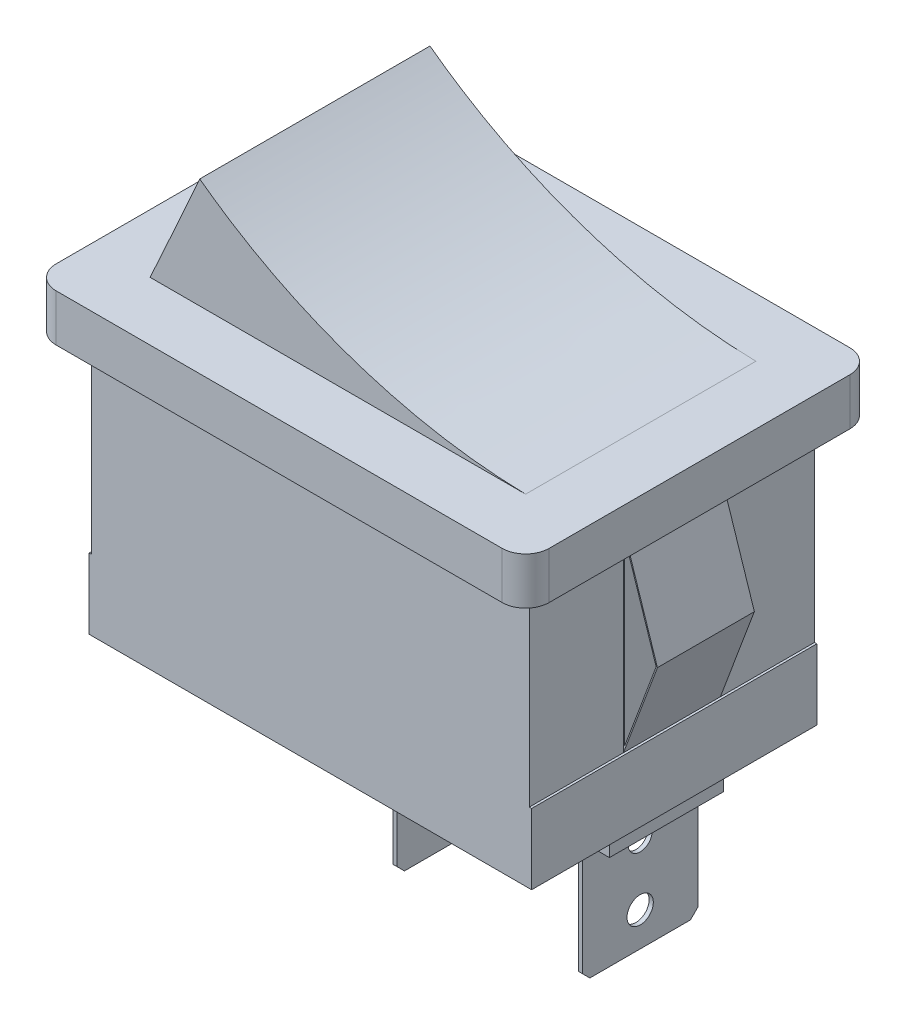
from build123d import *

# Parameters (mm, degrees)
SKETCH1_W           = 18.85
SKETCH1_H           = 12.15
BOSS_EXTRUDE1_DEPTH = 11.3
BOSS_EXTRUDE2_DEPTH = 2
BOSS_EXTRUDE4_DEPTH = 4.905
SKETCH5_W           = 12.15
SKETCH5_H           = 8.3
CUT_EXTRUDE2_DEPTH  = 0.1
BOSS_EXTRUDE5_DEPTH = 2.065
SKETCH7_W           = 1.12
SKETCH7_H           = 4.86
BOSS_EXTRUDE6_DEPTH = 0.8
LPATTERN1_COUNT     = 3
LPATTERN1_PITCH     = 7.9
BOSS_EXTRUDE7_DEPTH = 0.18
SKETCH9_R           = 0.513202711
SKETCH9_R_2         = 0.559835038
CUT_EXTRUDE3_DEPTH  = 0.18
LPATTERN11_COUNT    = 2
LPATTERN11_PITCH    = 7.9


with BuildPart() as part:
    # Sketch1 → Boss-Extrude1 (new body)
    with BuildSketch(Plane(origin=(0, 0, 0), x_dir=(1, 0, 0), z_dir=(0, 1, 0))):
        Rectangle(SKETCH1_W, SKETCH1_H)
    extrude(amount=BOSS_EXTRUDE1_DEPTH)

    # Sketch2 → Boss-Extrude2 (add)
    with BuildSketch(Plane(origin=(0, 11.3, 0), x_dir=(1, 0, 0), z_dir=(0, 1, 0))):
        with BuildLine():
            Line((9.5, -7.405), (-9.5, -7.405))
            ThreePointArc((-9.5, -7.405), (-10.207106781, -7.112106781), (-10.5, -6.405))
            Line((-10.5, -6.405), (-10.5, 6.405))
            ThreePointArc((-10.5, 6.405), (-10.207106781, 7.112106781), (-9.5, 7.405))
            Line((-9.5, 7.405), (9.5, 7.405))
            ThreePointArc((9.5, 7.405), (10.207106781, 7.112106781), (10.5, 6.405))
            Line((10.5, 6.405), (10.5, -6.405))
            ThreePointArc((10.5, -6.405), (10.207106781, -7.112106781), (9.5, -7.405))
        make_face()
    extrude(amount=BOSS_EXTRUDE2_DEPTH)

    # Sketch5 → Cut-Extrude2 (cut)
    with BuildSketch(Plane(origin=(9.425, 0, 0), x_dir=(0, 0, -1), z_dir=(1, 0, 0))):
        with Locations((0, 7.15)):
            Rectangle(SKETCH5_W, SKETCH5_H)
    cut_extrude2 = extrude(amount=-CUT_EXTRUDE2_DEPTH, mode=Mode.SUBTRACT)

    # Mirror1: Cut-Extrude2 across plane
    add(cut_extrude2.mirror(Plane(origin=(0, 0, 0), x_dir=(0, 0, 1), z_dir=(1, 0, 0))), mode=Mode.SUBTRACT)

    # Sketch6 → Boss-Extrude5 (add, symmetric)
    with BuildSketch(Plane.XY):
        Polygon((9.325, 3), (10.775, 6.867091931), (9.325, 11.3), align=None)
        Polygon((10.722023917, 6.868220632), (9.375, 10.986312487), (9.375, 3.275761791), align=None, mode=Mode.SUBTRACT)
    boss_extrude5 = extrude(amount=BOSS_EXTRUDE5_DEPTH, both=True)

    # Mirror2: Boss-Extrude5 across plane
    add(boss_extrude5.mirror(Plane(origin=(0, 0, 0), x_dir=(0, 0, 1), z_dir=(1, 0, 0))))

    # Sketch7 → Boss-Extrude6 (add)
    with BuildSketch(Plane.XZ):
        with Locations((-8.565, 0)):
            Rectangle(SKETCH7_W, SKETCH7_H)
        with Locations((-7.265, 0)):
            Rectangle(SKETCH7_W, SKETCH7_H)
    boss_extrude6 = extrude(amount=BOSS_EXTRUDE6_DEPTH)

    # LPattern1: Boss-Extrude6 ×3
    with Locations(*[(i * LPATTERN1_PITCH, 0, 0) for i in range(1, LPATTERN1_COUNT)]):
        add(boss_extrude6)

    # Sketch8 → Boss-Extrude7 (add)
    with BuildSketch(Plane(origin=(7.795, 0, 0), x_dir=(0, 0, -1), z_dir=(1, 0, 0))):
        with BuildLine():
            Line((2.762759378, 0), (2.762759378, -0.236886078))
            Line((2.762759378, -0.236886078), (2.602371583, -0.236886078))
            Line((2.602371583, -0.236886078), (2.457715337, -0.094744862))
            Line((2.457715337, -0.094744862), (2.457715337, -0.827279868))
            Line((2.457715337, -0.827279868), (2.349989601, -0.827279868))
            ThreePointArc((2.349989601, -0.827279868), (2.321976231, -0.886529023), (2.349989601, -0.945778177))
            Line((2.349989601, -0.945778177), (2.457715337, -0.945778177))
            Line((2.457715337, -0.945778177), (2.457715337, -5.631653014))
            Line((2.457715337, -5.631653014), (2.143590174, -5.945778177))
            Line((2.143590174, -5.945778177), (-2.143590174, -5.945778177))
            Line((-2.143590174, -5.945778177), (-2.457715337, -5.631653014))
            Line((-2.457715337, -5.631653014), (-2.457715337, -0.945778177))
            Line((-2.457715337, -0.945778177), (-2.349989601, -0.945778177))
            ThreePointArc((-2.349989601, -0.945778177), (-2.321976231, -0.886529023), (-2.349989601, -0.827279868))
            Line((-2.349989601, -0.827279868), (-2.457715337, -0.827279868))
            Line((-2.457715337, -0.827279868), (-2.457715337, -0.094744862))
            Line((-2.457715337, -0.094744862), (-2.602371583, -0.236886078))
            Line((-2.602371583, -0.236886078), (-2.762759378, -0.236886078))
            Line((-2.762759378, -0.236886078), (-2.762759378, 0))
            Line((-2.762759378, 0), (2.762759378, 0))
        make_face()
    boss_extrude7 = extrude(amount=BOSS_EXTRUDE7_DEPTH)

    # Sketch9 → Cut-Extrude3 (cut)
    with BuildSketch(Plane(origin=(7.975, 0, 0), x_dir=(0, 0, -1), z_dir=(1, 0, 0))):
        with Locations((0, -1.851868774)):
            Circle(SKETCH9_R)
        with Locations((0, -4.500588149)):
            Circle(SKETCH9_R_2)
    cut_extrude3 = extrude(amount=-CUT_EXTRUDE3_DEPTH, mode=Mode.SUBTRACT)

    # LPattern11: Boss-Extrude7, Cut-Extrude3 ×2
    with Locations(*[(-i * LPATTERN11_PITCH, 0, 0) for i in range(1, LPATTERN11_COUNT)]):
        add(boss_extrude7)
        add(cut_extrude3, mode=Mode.SUBTRACT)


with BuildPart() as body_2:
    # Sketch4 → Boss-Extrude4 (new, symmetric)
    with BuildSketch(Plane.XY):
        with BuildLine():
            Line((-8, 13.3), (8, 13.3))
            add(Edge.make_bspline(
                [(-5.885812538, 17.987984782), (-1.918868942, 15.043801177), (3.06563643, 13.390406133), (8, 13.3)],
                knots=[0, 0, 0, 0, 1, 1, 1, 1], degree=3))
            add(Edge.make_bspline(
                [(-8, 13.3), (-6.929404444, 15.637891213), (-5.885812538, 17.987984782)],
                knots=[0, 0, 0, 1, 1, 1], degree=2))
        make_face()
    extrude(amount=BOSS_EXTRUDE4_DEPTH, both=True)


solid = Compound([part.part, body_2.part])
